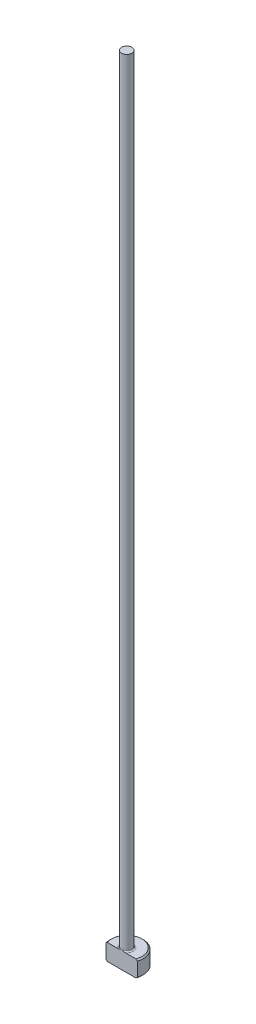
from build123d import *

# Parameters (mm, degrees)
CHAMFER1_SIZE = 0.254
FILLET1_R     = 0.254
KEY_DEPTH     = 153.466131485


with BuildPart() as part:
    # Sketch1 → Revolve1 (revolve)
    with BuildSketch(Plane.XY, mode=Mode.PRIVATE) as revolve1_sk:
        Polygon((0, 0), (-3.175, 0), (-3.175, 3.175), (-0.99187, 3.175), (-0.99187, 152.4), (0, 152.4), align=None)
    revolve(revolve1_sk.sketch.rotate(Axis((0, 259.958771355, 0), (0, -1, 0)), 270), axis=Axis((0, 259.958771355, 0), (0, -1, 0)))

    # Chamfer1
    chamfer1_edges = [part.edges().sort_by_distance(p)[0] for p in [
        (0, 3.175, -3.175),
        (0, 0, -3.175),
    ]]
    chamfer(chamfer1_edges, length=CHAMFER1_SIZE)

    # Fillet1
    fillet1_edges = [part.edges().sort_by_distance(p)[0] for p in [
        (0, 3.175, -0.99187),
    ]]
    fillet(fillet1_edges, radius=FILLET1_R)

    # Sketch2 → Key (cut, through all)
    with BuildSketch(Plane(origin=(0, 0, 0), x_dir=(1, 0, 0), z_dir=(0, 1, 0))):
        with BuildLine():
            Line((-3.016093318, -0.99187), (3.016093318, -0.99187))
            ThreePointArc((3.016093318, -0.99187), (0, -3.175), (-3.016093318, -0.99187))
        make_face()
    extrude(amount=KEY_DEPTH, mode=Mode.SUBTRACT)


solid = part.part
